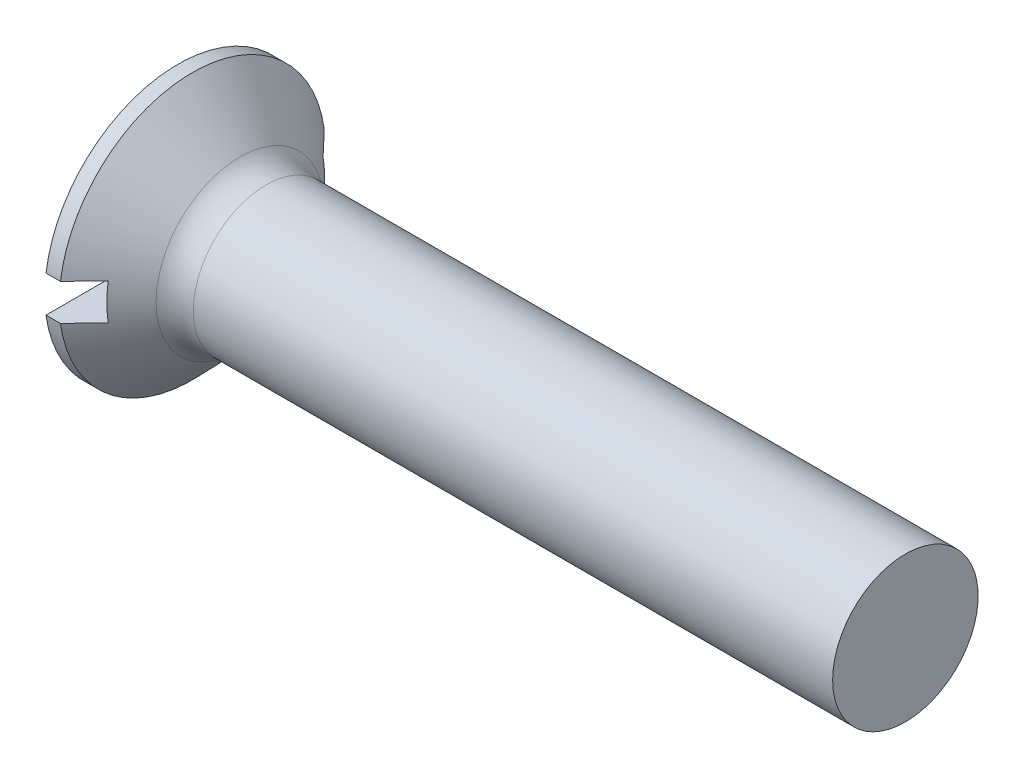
from build123d import *

# Parameters (mm, degrees)
FILLET1_R  = 2.5
SKETCH2_W  = 18.3
SKETCH2_H  = 2.5
SLOT_DEPTH = 2.6


with BuildPart() as part:
    # BodySke → Base-Revolve (revolve)
    with BuildSketch(Plane.XY, mode=Mode.PRIVATE) as base_revolve_sk:
        Polygon((0, 0), (0, 9.15), (0.992391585, 9.15), (5, 5), (50, 5), (50, 0), align=None)
    revolve(base_revolve_sk.sketch.rotate(Axis((-6.35, 0, 0), (1, 0, 0)), 90), axis=Axis((-6.35, 0, 0), (1, 0, 0)))

    # Fillet1
    fillet1_edges = [part.edges().sort_by_distance(p)[0] for p in [
        (5, 0, -5),
    ]]
    fillet(fillet1_edges, radius=FILLET1_R)

    # Sketch2 → Slot (cut)
    with BuildSketch(Plane.ZY):
        Rectangle(SKETCH2_W, SKETCH2_H)
    extrude(amount=-SLOT_DEPTH, mode=Mode.SUBTRACT)


solid = part.part
